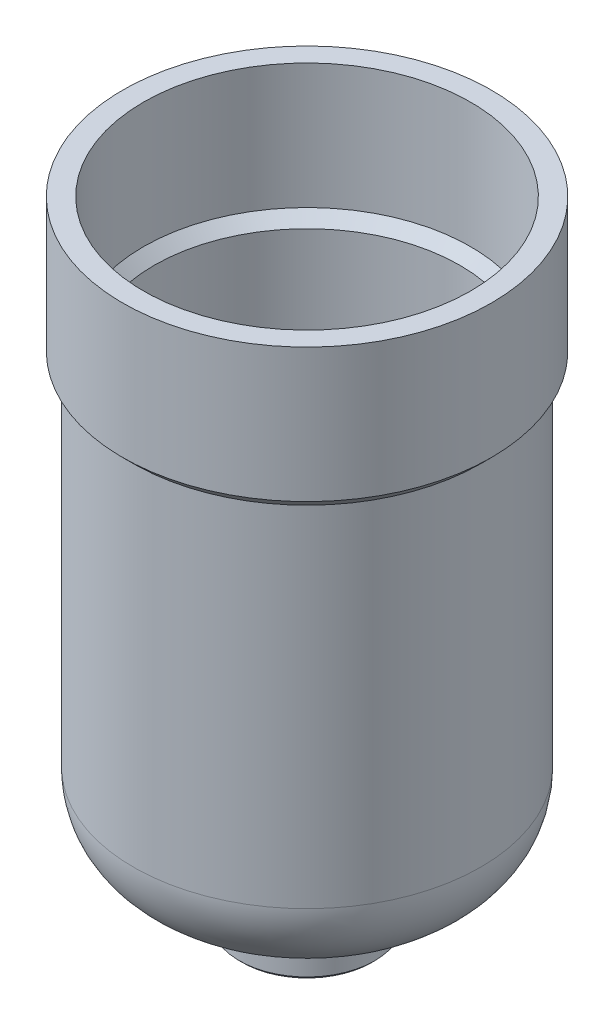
from build123d import *


with BuildPart() as part:
    # Sketch 1 → Revolve 1 (revolve)
    with BuildSketch(Plane.XY, mode=Mode.PRIVATE) as revolve_1_sk:
        with BuildLine():
            Line((0, -60.7), (-6.2, -60.7))
            Line((-6.2, -60.7), (-6.5, -60.4))
            Line((-6.5, -60.4), (-6.5, -56.5))
            ThreePointArc((-6.5, -56.5), (-6.792893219, -55.792893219), (-7.5, -55.5))
            Line((-7.5, -55.5), (-8.7, -55.5))
            ThreePointArc((-8.7, -55.5), (-14.356854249, -53.156854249), (-16.7, -47.5))
            Line((-16.7, -47.5), (-16.7, -13.9))
            Line((-16.7, -13.9), (-17.7325, -12.8675))
            Line((-17.7325, -12.8675), (-17.7325, 0))
            Line((-17.7325, 0), (-15.7325, 0))
            Line((-15.7325, 0), (-15.7325, -12.039072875))
            Line((-15.7325, -12.039072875), (-14.7, -13.071572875))
            Line((-14.7, -13.071572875), (-14.7, -45.5))
            ThreePointArc((-14.7, -45.5), (-12.356854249, -51.156854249), (-6.7, -53.5))
            Line((-6.7, -53.5), (0, -53.5))
            Line((0, -53.5), (0, -60.7))
        make_face()
    revolve(revolve_1_sk.sketch.rotate(Axis((0, 0, 0), (0, -1, 0)), 180), axis=Axis((0, 0, 0), (0, -1, 0)))


solid = part.part
